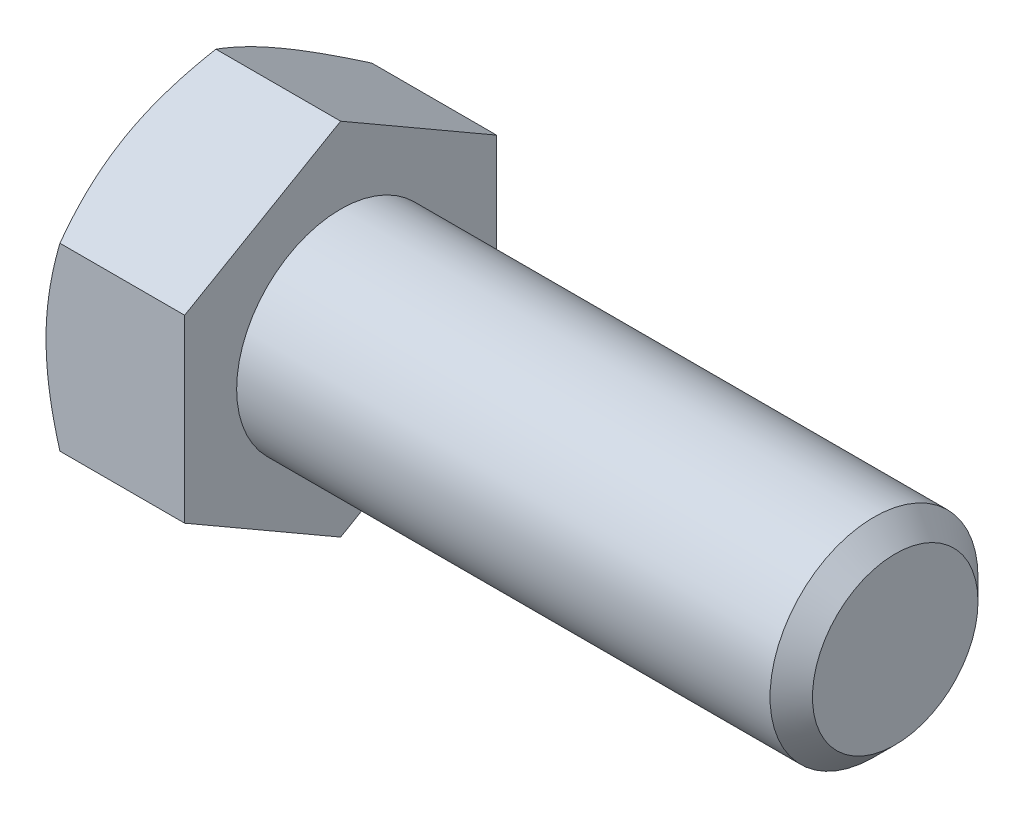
from build123d import *

# Parameters (mm, degrees)
SKETCH5_R           = 4.7625
BOSS_EXTRUDE3_DEPTH = 25.4
CHAMFER1_SIZE       = 0.97155
BOSS_EXTRUDE4_DEPTH = 6.35
SKETCH8_OUTSIDE_W   = 143.758
SKETCH8_OUTSIDE_H   = 145.968
SKETCH8_OUTSIDE_R   = 7.14375
CUT_EXTRUDE3_DEPTH  = 34.572903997
CUT_EXTRUDE3_DRAFT  = -60


with BuildPart() as part:
    # Sketch5 → Boss-Extrude3 (new body)
    with BuildSketch(Plane(origin=(15.875, 0, 0), x_dir=(0, 0, -1), z_dir=(1, 0, 0))):
        Circle(SKETCH5_R)
    extrude(amount=-BOSS_EXTRUDE3_DEPTH)

    # Chamfer1
    chamfer1_edges = [part.edges().sort_by_distance(p)[0] for p in [
        (15.875, 0, 4.7625),
    ]]
    chamfer(chamfer1_edges, length=CHAMFER1_SIZE)

    # Sketch6 → Boss-Extrude4 (add)
    with BuildSketch(Plane.ZY.offset(9.525)):
        Polygon((7.14375, 4.124445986), (0, 8.248891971), (-7.14375, 4.124445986), (-7.14375, -4.124445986), (0, -8.248891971), (7.14375, -4.124445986), align=None)
    extrude(amount=BOSS_EXTRUDE4_DEPTH)


with BuildPart() as cut_extrude3_tool:
    # Sketch8 outside → Cut-Extrude3 (with draft: the straight prism first)
    with BuildSketch(Plane.ZY.offset(15.875)):
        Rectangle(SKETCH8_OUTSIDE_W, SKETCH8_OUTSIDE_H)
        Circle(SKETCH8_OUTSIDE_R, mode=Mode.SUBTRACT)
    extrude(amount=-CUT_EXTRUDE3_DEPTH)
    # Cut-Extrude3: the draft: its side faces are tilted about the plane it starts from
    cut_extrude3_sides = [cut_extrude3_tool.faces().sort_by_distance(p)[0] for p in [
        (1.411451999, -72.984, 0),
        (1.411451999, 0, 71.879),
        (1.411451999, 72.984, 0),
        (1.411451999, 0, -71.879),
        (1.411451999, 0, -7.14375),
    ]]
    draft(cut_extrude3_sides, Plane.ZY.offset(15.875), CUT_EXTRUDE3_DRAFT)


with BuildPart() as part_1:
    add(part.part)

    # Cut-Extrude3: cut by cut_extrude3_tool
    add(cut_extrude3_tool.part, mode=Mode.SUBTRACT)


solid = part_1.part
